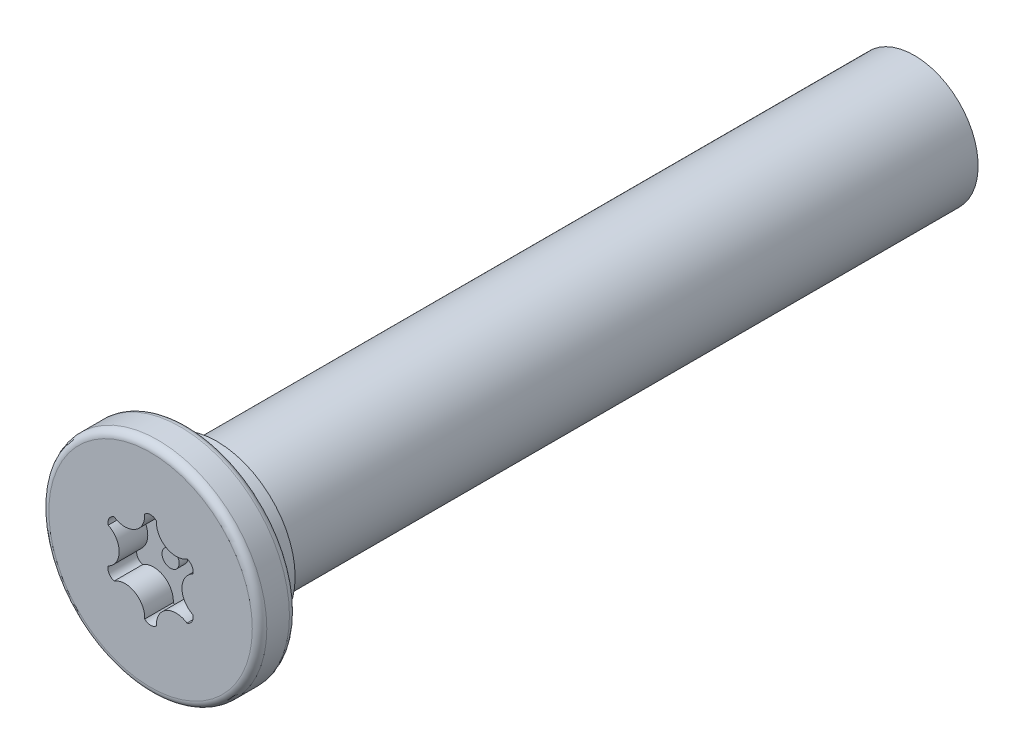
ISO-10303-21;
HEADER;
FILE_DESCRIPTION(('STEP AP214'),'2;1');
FILE_NAME('part.step','',(''),(''),'','','');
FILE_SCHEMA(('AUTOMOTIVE_DESIGN { 1 0 10303 214 1 1 1 1 }'));
ENDSEC;
DATA;
#1=APPLICATION_CONTEXT('core data for automotive mechanical design processes');
#2=APPLICATION_PROTOCOL_DEFINITION('international standard','automotive_design',2000,#1);
#3=PRODUCT_CONTEXT('',#1,'mechanical');
#4=PRODUCT('Part','Part','',(#3));
#5=PRODUCT_RELATED_PRODUCT_CATEGORY('part','',(#4));
#6=PRODUCT_DEFINITION_FORMATION('','',#4);
#7=PRODUCT_DEFINITION_CONTEXT('part definition',#1,'design');
#8=PRODUCT_DEFINITION('design','',#6,#7);
#9=PRODUCT_DEFINITION_SHAPE('','',#8);
#10=(LENGTH_UNIT() NAMED_UNIT(*) SI_UNIT(.MILLI.,.METRE.));
#11=(NAMED_UNIT(*) PLANE_ANGLE_UNIT() SI_UNIT($,.RADIAN.));
#12=(NAMED_UNIT(*) SI_UNIT($,.STERADIAN.) SOLID_ANGLE_UNIT());
#13=UNCERTAINTY_MEASURE_WITH_UNIT(LENGTH_MEASURE(1.E-05),#10,'distance_accuracy_value','');
#14=(GEOMETRIC_REPRESENTATION_CONTEXT(3) GLOBAL_UNCERTAINTY_ASSIGNED_CONTEXT((#13)) GLOBAL_UNIT_ASSIGNED_CONTEXT((#10,
#11,#12)) REPRESENTATION_CONTEXT('',''));
#15=CARTESIAN_POINT('',(0.,0.,0.));
#16=DIRECTION('',(0.,0.,1.));
#17=DIRECTION('',(1.,0.,0.));
#18=AXIS2_PLACEMENT_3D('',#15,#16,#17);
#19=CARTESIAN_POINT('',(0.,0.,0.));
#20=DIRECTION('',(0.,0.,1.));
#21=DIRECTION('',(1.,0.,0.));
#22=AXIS2_PLACEMENT_3D('',#19,#20,#21);
#23=PLANE('',#22);
#24=CARTESIAN_POINT('',(0.,0.,0.));
#25=DIRECTION('',(0.,0.,1.));
#26=DIRECTION('',(1.,0.,0.));
#27=AXIS2_PLACEMENT_3D('',#24,#25,#26);
#28=CIRCLE('',#27,3.55599999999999);
#29=CARTESIAN_POINT('',(3.55599999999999,0.,0.));
#30=VERTEX_POINT('',#29);
#31=EDGE_CURVE('E54',#30,#30,#28,.T.);
#32=ORIENTED_EDGE('',*,*,#31,.T.);
#33=EDGE_LOOP('',(#32));
#34=FACE_BOUND('',#33,.T.);
#35=CARTESIAN_POINT('',(0.893828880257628,1.54815703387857,0.));
#36=DIRECTION('',(0.,0.,1.));
#37=DIRECTION('',(1.,0.,0.));
#38=AXIS2_PLACEMENT_3D('',#35,#36,#37);
#39=CIRCLE('',#38,0.69);
#40=CARTESIAN_POINT('',(0.205060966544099,1.58937306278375,0.));
#41=VERTEX_POINT('',#40);
#42=CARTESIAN_POINT('',(1.27390696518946,0.972274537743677,0.));
#43=VERTEX_POINT('',#42);
#44=EDGE_CURVE('E181',#41,#43,#39,.T.);
#45=ORIENTED_EDGE('',*,*,#44,.T.);
#46=CARTESIAN_POINT('',(1.19884944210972,0.692156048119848,0.));
#47=DIRECTION('',(0.,0.,1.));
#48=DIRECTION('',(1.,0.,0.));
#49=AXIS2_PLACEMENT_3D('',#46,#47,#48);
#50=CIRCLE('',#49,0.29);
#51=CARTESIAN_POINT('',(1.47896793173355,0.617098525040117,0.));
#52=VERTEX_POINT('',#51);
#53=EDGE_CURVE('E61',#43,#52,#50,.F.);
#54=ORIENTED_EDGE('',*,*,#53,.T.);
#55=CARTESIAN_POINT('',(1.78765776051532,0.,0.));
#56=DIRECTION('',(0.,0.,1.));
#57=DIRECTION('',(1.,0.,0.));
#58=AXIS2_PLACEMENT_3D('',#55,#56,#57);
#59=CIRCLE('',#58,0.69);
#60=CARTESIAN_POINT('',(1.47896793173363,-0.617098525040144,0.));
#61=VERTEX_POINT('',#60);
#62=EDGE_CURVE('E111',#52,#61,#59,.T.);
#63=ORIENTED_EDGE('',*,*,#62,.T.);
#64=CARTESIAN_POINT('',(1.1988494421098,-0.692156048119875,0.));
#65=DIRECTION('',(0.,0.,1.));
#66=DIRECTION('',(1.,0.,0.));
#67=AXIS2_PLACEMENT_3D('',#64,#65,#66);
#68=CIRCLE('',#67,0.29);
#69=CARTESIAN_POINT('',(1.27390696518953,-0.972274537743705,0.));
#70=VERTEX_POINT('',#69);
#71=EDGE_CURVE('E216',#61,#70,#68,.F.);
#72=ORIENTED_EDGE('',*,*,#71,.T.);
#73=CARTESIAN_POINT('',(0.893828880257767,-1.54815703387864,0.));
#74=DIRECTION('',(0.,0.,1.));
#75=DIRECTION('',(1.,0.,0.));
#76=AXIS2_PLACEMENT_3D('',#73,#74,#75);
#77=CIRCLE('',#76,0.69);
#78=CARTESIAN_POINT('',(0.205060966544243,-1.5893730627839,0.));
#79=VERTEX_POINT('',#78);
#80=EDGE_CURVE('E160',#70,#79,#77,.T.);
#81=ORIENTED_EDGE('',*,*,#80,.T.);
#82=CARTESIAN_POINT('',(1.43067375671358E-13,-1.3843120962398,0.));
#83=DIRECTION('',(0.,0.,1.));
#84=DIRECTION('',(1.,0.,0.));
#85=AXIS2_PLACEMENT_3D('',#82,#83,#84);
#86=CIRCLE('',#85,0.29);
#87=CARTESIAN_POINT('',(-0.205060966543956,-1.5893730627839,0.));
#88=VERTEX_POINT('',#87);
#89=EDGE_CURVE('E210',#79,#88,#86,.F.);
#90=ORIENTED_EDGE('',*,*,#89,.T.);
#91=CARTESIAN_POINT('',(-0.893828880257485,-1.54815703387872,0.));
#92=DIRECTION('',(0.,0.,1.));
#93=DIRECTION('',(1.,0.,0.));
#94=AXIS2_PLACEMENT_3D('',#91,#92,#93);
#95=CIRCLE('',#94,0.69);
#96=CARTESIAN_POINT('',(-1.27390696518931,-0.97227453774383,0.));
#97=VERTEX_POINT('',#96);
#98=EDGE_CURVE('E206',#88,#97,#95,.T.);
#99=ORIENTED_EDGE('',*,*,#98,.T.);
#100=CARTESIAN_POINT('',(-1.19884944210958,-0.69215604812,0.));
#101=DIRECTION('',(0.,0.,1.));
#102=DIRECTION('',(1.,0.,0.));
#103=AXIS2_PLACEMENT_3D('',#100,#101,#102);
#104=CIRCLE('',#103,0.29);
#105=CARTESIAN_POINT('',(-1.47896793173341,-0.617098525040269,0.));
#106=VERTEX_POINT('',#105);
#107=EDGE_CURVE('E202',#97,#106,#104,.F.);
#108=ORIENTED_EDGE('',*,*,#107,.T.);
#109=CARTESIAN_POINT('',(-1.78765776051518,-1.56674837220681E-13,0.));
#110=DIRECTION('',(0.,0.,1.));
#111=DIRECTION('',(1.,0.,0.));
#112=AXIS2_PLACEMENT_3D('',#109,#110,#111);
#113=CIRCLE('',#112,0.69);
#114=CARTESIAN_POINT('',(-1.47896793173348,0.617098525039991,0.));
#115=VERTEX_POINT('',#114);
#116=EDGE_CURVE('E198',#106,#115,#113,.T.);
#117=ORIENTED_EDGE('',*,*,#116,.T.);
#118=CARTESIAN_POINT('',(-1.19884944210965,0.692156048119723,0.));
#119=DIRECTION('',(0.,0.,1.));
#120=DIRECTION('',(1.,0.,0.));
#121=AXIS2_PLACEMENT_3D('',#118,#119,#120);
#122=CIRCLE('',#121,0.29);
#123=CARTESIAN_POINT('',(-1.27390696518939,0.972274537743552,0.));
#124=VERTEX_POINT('',#123);
#125=EDGE_CURVE('E194',#115,#124,#122,.F.);
#126=ORIENTED_EDGE('',*,*,#125,.T.);
#127=CARTESIAN_POINT('',(-0.893828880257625,1.54815703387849,0.));
#128=DIRECTION('',(0.,0.,1.));
#129=DIRECTION('',(1.,0.,0.));
#130=AXIS2_PLACEMENT_3D('',#127,#128,#129);
#131=CIRCLE('',#130,0.690000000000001);
#132=CARTESIAN_POINT('',(-0.205060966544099,1.58937306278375,0.));
#133=VERTEX_POINT('',#132);
#134=EDGE_CURVE('E190',#124,#133,#131,.T.);
#135=ORIENTED_EDGE('',*,*,#134,.T.);
#136=CARTESIAN_POINT('',(0.,1.38431209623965,0.));
#137=DIRECTION('',(0.,0.,1.));
#138=DIRECTION('',(1.,0.,0.));
#139=AXIS2_PLACEMENT_3D('',#136,#137,#138);
#140=CIRCLE('',#139,0.29);
#141=EDGE_CURVE('E186',#133,#41,#140,.F.);
#142=ORIENTED_EDGE('',*,*,#141,.T.);
#143=EDGE_LOOP('',(#45,#54,#63,#72,#81,#90,#99,#108,#117,#126,#135,#142));
#144=FACE_BOUND('',#143,.T.);
#145=ADVANCED_FACE('F45',(#34,#144),#23,.T.);
#146=CARTESIAN_POINT('',(0.,0.,-1.3));
#147=DIRECTION('',(0.,0.,1.));
#148=DIRECTION('',(1.,0.,0.));
#149=AXIS2_PLACEMENT_3D('',#146,#147,#148);
#150=PLANE('',#149);
#151=CARTESIAN_POINT('',(0.,0.,-1.3));
#152=DIRECTION('',(0.,0.,1.));
#153=DIRECTION('',(1.,0.,0.));
#154=AXIS2_PLACEMENT_3D('',#151,#152,#153);
#155=CIRCLE('',#154,2.738000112);
#156=CARTESIAN_POINT('',(2.738000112,0.,-1.3));
#157=VERTEX_POINT('',#156);
#158=EDGE_CURVE('E11',#157,#157,#155,.F.);
#159=ORIENTED_EDGE('',*,*,#158,.F.);
#160=EDGE_LOOP('',(#159));
#161=FACE_BOUND('',#160,.T.);
#162=CARTESIAN_POINT('',(0.,0.,-1.3));
#163=DIRECTION('',(0.,0.,1.));
#164=DIRECTION('',(1.,0.,0.));
#165=AXIS2_PLACEMENT_3D('',#162,#163,#164);
#166=CIRCLE('',#165,3.55599999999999);
#167=CARTESIAN_POINT('',(3.55599999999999,0.,-1.3));
#168=VERTEX_POINT('',#167);
#169=EDGE_CURVE('E260',#168,#168,#166,.F.);
#170=ORIENTED_EDGE('',*,*,#169,.T.);
#171=EDGE_LOOP('',(#170));
#172=FACE_BOUND('',#171,.T.);
#173=ADVANCED_FACE('F283',(#161,#172),#150,.F.);
#174=CARTESIAN_POINT('',(0.,0.,-1.3));
#175=DIRECTION('',(0.,0.,1.));
#176=DIRECTION('',(1.,0.,0.));
#177=AXIS2_PLACEMENT_3D('',#174,#175,#176);
#178=CYLINDRICAL_SURFACE('',#177,3.80999999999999);
#179=CARTESIAN_POINT('',(0.,0.,-1.046));
#180=DIRECTION('',(0.,0.,1.));
#181=DIRECTION('',(1.,0.,0.));
#182=AXIS2_PLACEMENT_3D('',#179,#180,#181);
#183=CIRCLE('',#182,3.80999999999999);
#184=CARTESIAN_POINT('',(3.80999999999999,0.,-1.046));
#185=VERTEX_POINT('',#184);
#186=EDGE_CURVE('E256',#185,#185,#183,.T.);
#187=ORIENTED_EDGE('',*,*,#186,.T.);
#188=EDGE_LOOP('',(#187));
#189=FACE_BOUND('',#188,.T.);
#190=CARTESIAN_POINT('',(0.,0.,-0.254));
#191=DIRECTION('',(0.,0.,1.));
#192=DIRECTION('',(1.,0.,0.));
#193=AXIS2_PLACEMENT_3D('',#190,#191,#192);
#194=CIRCLE('',#193,3.80999999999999);
#195=CARTESIAN_POINT('',(3.80999999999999,0.,-0.254));
#196=VERTEX_POINT('',#195);
#197=EDGE_CURVE('E225',#196,#196,#194,.F.);
#198=ORIENTED_EDGE('',*,*,#197,.T.);
#199=EDGE_LOOP('',(#198));
#200=FACE_BOUND('',#199,.T.);
#201=ADVANCED_FACE('F289',(#189,#200),#178,.T.);
#202=CARTESIAN_POINT('',(1.19884944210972,0.692156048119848,-1.));
#203=DIRECTION('',(0.,0.,1.));
#204=DIRECTION('',(1.,0.,0.));
#205=AXIS2_PLACEMENT_3D('',#202,#203,#204);
#206=CYLINDRICAL_SURFACE('',#205,0.29);
#207=ORIENTED_EDGE('',*,*,#53,.F.);
#208=DIRECTION('',(0.,0.,1.));
#209=VECTOR('',#208,1.);
#210=CARTESIAN_POINT('',(1.27390696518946,0.972274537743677,-1.));
#211=LINE('',#210,#209);
#212=CARTESIAN_POINT('',(1.27390696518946,0.972274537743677,-1.));
#213=VERTEX_POINT('',#212);
#214=EDGE_CURVE('E178',#213,#43,#211,.T.);
#215=ORIENTED_EDGE('',*,*,#214,.F.);
#216=CARTESIAN_POINT('',(1.19884944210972,0.692156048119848,-1.));
#217=DIRECTION('',(0.,0.,1.));
#218=DIRECTION('',(1.,0.,0.));
#219=AXIS2_PLACEMENT_3D('',#216,#217,#218);
#220=CIRCLE('',#219,0.29);
#221=CARTESIAN_POINT('',(1.47896793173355,0.617098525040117,-1.));
#222=VERTEX_POINT('',#221);
#223=EDGE_CURVE('E221',#213,#222,#220,.F.);
#224=ORIENTED_EDGE('',*,*,#223,.T.);
#225=DIRECTION('',(0.,0.,1.));
#226=VECTOR('',#225,1.);
#227=CARTESIAN_POINT('',(1.47896793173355,0.617098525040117,-1.));
#228=LINE('',#227,#226);
#229=EDGE_CURVE('E222',#222,#52,#228,.T.);
#230=ORIENTED_EDGE('',*,*,#229,.T.);
#231=EDGE_LOOP('',(#207,#215,#224,#230));
#232=FACE_BOUND('',#231,.T.);
#233=ADVANCED_FACE('F294',(#232),#206,.F.);
#234=CARTESIAN_POINT('',(1.78765776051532,0.,-1.));
#235=DIRECTION('',(0.,0.,1.));
#236=DIRECTION('',(1.,0.,0.));
#237=AXIS2_PLACEMENT_3D('',#234,#235,#236);
#238=CYLINDRICAL_SURFACE('',#237,0.69);
#239=ORIENTED_EDGE('',*,*,#62,.F.);
#240=ORIENTED_EDGE('',*,*,#229,.F.);
#241=CARTESIAN_POINT('',(1.78765776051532,0.,-1.));
#242=DIRECTION('',(0.,0.,1.));
#243=DIRECTION('',(1.,0.,0.));
#244=AXIS2_PLACEMENT_3D('',#241,#242,#243);
#245=CIRCLE('',#244,0.69);
#246=CARTESIAN_POINT('',(1.47896793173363,-0.617098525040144,-1.));
#247=VERTEX_POINT('',#246);
#248=EDGE_CURVE('E70',#222,#247,#245,.T.);
#249=ORIENTED_EDGE('',*,*,#248,.T.);
#250=DIRECTION('',(0.,0.,1.));
#251=VECTOR('',#250,1.);
#252=CARTESIAN_POINT('',(1.47896793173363,-0.617098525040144,-1.));
#253=LINE('',#252,#251);
#254=EDGE_CURVE('E151',#247,#61,#253,.T.);
#255=ORIENTED_EDGE('',*,*,#254,.T.);
#256=EDGE_LOOP('',(#239,#240,#249,#255));
#257=FACE_BOUND('',#256,.T.);
#258=ADVANCED_FACE('F301',(#257),#238,.T.);
#259=CARTESIAN_POINT('',(1.1988494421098,-0.692156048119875,-1.));
#260=DIRECTION('',(0.,0.,1.));
#261=DIRECTION('',(1.,0.,0.));
#262=AXIS2_PLACEMENT_3D('',#259,#260,#261);
#263=CYLINDRICAL_SURFACE('',#262,0.29);
#264=ORIENTED_EDGE('',*,*,#71,.F.);
#265=ORIENTED_EDGE('',*,*,#254,.F.);
#266=CARTESIAN_POINT('',(1.1988494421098,-0.692156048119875,-1.));
#267=DIRECTION('',(0.,0.,1.));
#268=DIRECTION('',(1.,0.,0.));
#269=AXIS2_PLACEMENT_3D('',#266,#267,#268);
#270=CIRCLE('',#269,0.29);
#271=CARTESIAN_POINT('',(1.27390696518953,-0.972274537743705,-1.));
#272=VERTEX_POINT('',#271);
#273=EDGE_CURVE('E145',#247,#272,#270,.F.);
#274=ORIENTED_EDGE('',*,*,#273,.T.);
#275=DIRECTION('',(0.,0.,1.));
#276=VECTOR('',#275,1.);
#277=CARTESIAN_POINT('',(1.27390696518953,-0.972274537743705,-1.));
#278=LINE('',#277,#276);
#279=EDGE_CURVE('E149',#272,#70,#278,.T.);
#280=ORIENTED_EDGE('',*,*,#279,.T.);
#281=EDGE_LOOP('',(#264,#265,#274,#280));
#282=FACE_BOUND('',#281,.T.);
#283=ADVANCED_FACE('F148',(#282),#263,.F.);
#284=CARTESIAN_POINT('',(0.893828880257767,-1.54815703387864,-1.));
#285=DIRECTION('',(0.,0.,1.));
#286=DIRECTION('',(1.,0.,0.));
#287=AXIS2_PLACEMENT_3D('',#284,#285,#286);
#288=CYLINDRICAL_SURFACE('',#287,0.69);
#289=ORIENTED_EDGE('',*,*,#80,.F.);
#290=ORIENTED_EDGE('',*,*,#279,.F.);
#291=CARTESIAN_POINT('',(0.893828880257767,-1.54815703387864,-1.));
#292=DIRECTION('',(0.,0.,1.));
#293=DIRECTION('',(1.,0.,0.));
#294=AXIS2_PLACEMENT_3D('',#291,#292,#293);
#295=CIRCLE('',#294,0.69);
#296=CARTESIAN_POINT('',(0.205060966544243,-1.5893730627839,-1.));
#297=VERTEX_POINT('',#296);
#298=EDGE_CURVE('E154',#272,#297,#295,.T.);
#299=ORIENTED_EDGE('',*,*,#298,.T.);
#300=DIRECTION('',(0.,0.,1.));
#301=VECTOR('',#300,1.);
#302=CARTESIAN_POINT('',(0.205060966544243,-1.5893730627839,-1.));
#303=LINE('',#302,#301);
#304=EDGE_CURVE('E163',#297,#79,#303,.T.);
#305=ORIENTED_EDGE('',*,*,#304,.T.);
#306=EDGE_LOOP('',(#289,#290,#299,#305));
#307=FACE_BOUND('',#306,.T.);
#308=ADVANCED_FACE('F157',(#307),#288,.T.);
#309=CARTESIAN_POINT('',(1.43067375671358E-13,-1.3843120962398,-1.));
#310=DIRECTION('',(0.,0.,1.));
#311=DIRECTION('',(1.,0.,0.));
#312=AXIS2_PLACEMENT_3D('',#309,#310,#311);
#313=CYLINDRICAL_SURFACE('',#312,0.29);
#314=ORIENTED_EDGE('',*,*,#89,.F.);
#315=ORIENTED_EDGE('',*,*,#304,.F.);
#316=CARTESIAN_POINT('',(1.43067375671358E-13,-1.3843120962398,-1.));
#317=DIRECTION('',(0.,0.,1.));
#318=DIRECTION('',(1.,0.,0.));
#319=AXIS2_PLACEMENT_3D('',#316,#317,#318);
#320=CIRCLE('',#319,0.29);
#321=CARTESIAN_POINT('',(-0.205060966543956,-1.5893730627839,-1.));
#322=VERTEX_POINT('',#321);
#323=EDGE_CURVE('E168',#297,#322,#320,.F.);
#324=ORIENTED_EDGE('',*,*,#323,.T.);
#325=DIRECTION('',(0.,0.,1.));
#326=VECTOR('',#325,1.);
#327=CARTESIAN_POINT('',(-0.205060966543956,-1.5893730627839,-1.));
#328=LINE('',#327,#326);
#329=EDGE_CURVE('E230',#322,#88,#328,.T.);
#330=ORIENTED_EDGE('',*,*,#329,.T.);
#331=EDGE_LOOP('',(#314,#315,#324,#330));
#332=FACE_BOUND('',#331,.T.);
#333=ADVANCED_FACE('F318',(#332),#313,.F.);
#334=CARTESIAN_POINT('',(-0.893828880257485,-1.54815703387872,-1.));
#335=DIRECTION('',(0.,0.,1.));
#336=DIRECTION('',(1.,0.,0.));
#337=AXIS2_PLACEMENT_3D('',#334,#335,#336);
#338=CYLINDRICAL_SURFACE('',#337,0.69);
#339=ORIENTED_EDGE('',*,*,#98,.F.);
#340=ORIENTED_EDGE('',*,*,#329,.F.);
#341=CARTESIAN_POINT('',(-0.893828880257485,-1.54815703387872,-1.));
#342=DIRECTION('',(0.,0.,1.));
#343=DIRECTION('',(1.,0.,0.));
#344=AXIS2_PLACEMENT_3D('',#341,#342,#343);
#345=CIRCLE('',#344,0.69);
#346=CARTESIAN_POINT('',(-1.27390696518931,-0.97227453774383,-1.));
#347=VERTEX_POINT('',#346);
#348=EDGE_CURVE('E172',#322,#347,#345,.T.);
#349=ORIENTED_EDGE('',*,*,#348,.T.);
#350=DIRECTION('',(0.,0.,1.));
#351=VECTOR('',#350,1.);
#352=CARTESIAN_POINT('',(-1.27390696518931,-0.97227453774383,-1.));
#353=LINE('',#352,#351);
#354=EDGE_CURVE('E233',#347,#97,#353,.T.);
#355=ORIENTED_EDGE('',*,*,#354,.T.);
#356=EDGE_LOOP('',(#339,#340,#349,#355));
#357=FACE_BOUND('',#356,.T.);
#358=ADVANCED_FACE('F321',(#357),#338,.T.);
#359=CARTESIAN_POINT('',(-1.19884944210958,-0.69215604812,-1.));
#360=DIRECTION('',(0.,0.,1.));
#361=DIRECTION('',(1.,0.,0.));
#362=AXIS2_PLACEMENT_3D('',#359,#360,#361);
#363=CYLINDRICAL_SURFACE('',#362,0.29);
#364=ORIENTED_EDGE('',*,*,#107,.F.);
#365=ORIENTED_EDGE('',*,*,#354,.F.);
#366=CARTESIAN_POINT('',(-1.19884944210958,-0.69215604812,-1.));
#367=DIRECTION('',(0.,0.,1.));
#368=DIRECTION('',(1.,0.,0.));
#369=AXIS2_PLACEMENT_3D('',#366,#367,#368);
#370=CIRCLE('',#369,0.29);
#371=CARTESIAN_POINT('',(-1.47896793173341,-0.617098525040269,-1.));
#372=VERTEX_POINT('',#371);
#373=EDGE_CURVE('E374',#347,#372,#370,.F.);
#374=ORIENTED_EDGE('',*,*,#373,.T.);
#375=DIRECTION('',(0.,0.,1.));
#376=VECTOR('',#375,1.);
#377=CARTESIAN_POINT('',(-1.47896793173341,-0.617098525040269,-1.));
#378=LINE('',#377,#376);
#379=EDGE_CURVE('E236',#372,#106,#378,.T.);
#380=ORIENTED_EDGE('',*,*,#379,.T.);
#381=EDGE_LOOP('',(#364,#365,#374,#380));
#382=FACE_BOUND('',#381,.T.);
#383=ADVANCED_FACE('F325',(#382),#363,.F.);
#384=CARTESIAN_POINT('',(-1.78765776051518,-1.56674837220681E-13,-1.));
#385=DIRECTION('',(0.,0.,1.));
#386=DIRECTION('',(1.,0.,0.));
#387=AXIS2_PLACEMENT_3D('',#384,#385,#386);
#388=CYLINDRICAL_SURFACE('',#387,0.69);
#389=ORIENTED_EDGE('',*,*,#116,.F.);
#390=ORIENTED_EDGE('',*,*,#379,.F.);
#391=CARTESIAN_POINT('',(-1.78765776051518,-1.56674837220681E-13,-1.));
#392=DIRECTION('',(0.,0.,1.));
#393=DIRECTION('',(1.,0.,0.));
#394=AXIS2_PLACEMENT_3D('',#391,#392,#393);
#395=CIRCLE('',#394,0.69);
#396=CARTESIAN_POINT('',(-1.47896793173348,0.617098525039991,-1.));
#397=VERTEX_POINT('',#396);
#398=EDGE_CURVE('E371',#372,#397,#395,.T.);
#399=ORIENTED_EDGE('',*,*,#398,.T.);
#400=DIRECTION('',(0.,0.,1.));
#401=VECTOR('',#400,1.);
#402=CARTESIAN_POINT('',(-1.47896793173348,0.617098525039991,-1.));
#403=LINE('',#402,#401);
#404=EDGE_CURVE('E239',#397,#115,#403,.T.);
#405=ORIENTED_EDGE('',*,*,#404,.T.);
#406=EDGE_LOOP('',(#389,#390,#399,#405));
#407=FACE_BOUND('',#406,.T.);
#408=ADVANCED_FACE('F329',(#407),#388,.T.);
#409=CARTESIAN_POINT('',(-1.19884944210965,0.692156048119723,-1.));
#410=DIRECTION('',(0.,0.,1.));
#411=DIRECTION('',(1.,0.,0.));
#412=AXIS2_PLACEMENT_3D('',#409,#410,#411);
#413=CYLINDRICAL_SURFACE('',#412,0.29);
#414=ORIENTED_EDGE('',*,*,#125,.F.);
#415=ORIENTED_EDGE('',*,*,#404,.F.);
#416=CARTESIAN_POINT('',(-1.19884944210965,0.692156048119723,-1.));
#417=DIRECTION('',(0.,0.,1.));
#418=DIRECTION('',(1.,0.,0.));
#419=AXIS2_PLACEMENT_3D('',#416,#417,#418);
#420=CIRCLE('',#419,0.29);
#421=CARTESIAN_POINT('',(-1.27390696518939,0.972274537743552,-1.));
#422=VERTEX_POINT('',#421);
#423=EDGE_CURVE('E364',#397,#422,#420,.F.);
#424=ORIENTED_EDGE('',*,*,#423,.T.);
#425=DIRECTION('',(0.,0.,1.));
#426=VECTOR('',#425,1.);
#427=CARTESIAN_POINT('',(-1.27390696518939,0.972274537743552,-1.));
#428=LINE('',#427,#426);
#429=EDGE_CURVE('E242',#422,#124,#428,.T.);
#430=ORIENTED_EDGE('',*,*,#429,.T.);
#431=EDGE_LOOP('',(#414,#415,#424,#430));
#432=FACE_BOUND('',#431,.T.);
#433=ADVANCED_FACE('F333',(#432),#413,.F.);
#434=CARTESIAN_POINT('',(-0.893828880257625,1.54815703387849,-1.));
#435=DIRECTION('',(0.,0.,1.));
#436=DIRECTION('',(1.,0.,0.));
#437=AXIS2_PLACEMENT_3D('',#434,#435,#436);
#438=CYLINDRICAL_SURFACE('',#437,0.690000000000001);
#439=ORIENTED_EDGE('',*,*,#134,.F.);
#440=ORIENTED_EDGE('',*,*,#429,.F.);
#441=CARTESIAN_POINT('',(-0.893828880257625,1.54815703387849,-1.));
#442=DIRECTION('',(0.,0.,1.));
#443=DIRECTION('',(1.,0.,0.));
#444=AXIS2_PLACEMENT_3D('',#441,#442,#443);
#445=CIRCLE('',#444,0.690000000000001);
#446=CARTESIAN_POINT('',(-0.205060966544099,1.58937306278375,-1.));
#447=VERTEX_POINT('',#446);
#448=EDGE_CURVE('E360',#422,#447,#445,.T.);
#449=ORIENTED_EDGE('',*,*,#448,.T.);
#450=DIRECTION('',(0.,0.,1.));
#451=VECTOR('',#450,1.);
#452=CARTESIAN_POINT('',(-0.205060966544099,1.58937306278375,-1.));
#453=LINE('',#452,#451);
#454=EDGE_CURVE('E245',#447,#133,#453,.T.);
#455=ORIENTED_EDGE('',*,*,#454,.T.);
#456=EDGE_LOOP('',(#439,#440,#449,#455));
#457=FACE_BOUND('',#456,.T.);
#458=ADVANCED_FACE('F337',(#457),#438,.T.);
#459=CARTESIAN_POINT('',(0.,1.38431209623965,-1.));
#460=DIRECTION('',(0.,0.,1.));
#461=DIRECTION('',(1.,0.,0.));
#462=AXIS2_PLACEMENT_3D('',#459,#460,#461);
#463=CYLINDRICAL_SURFACE('',#462,0.29);
#464=ORIENTED_EDGE('',*,*,#141,.F.);
#465=ORIENTED_EDGE('',*,*,#454,.F.);
#466=CARTESIAN_POINT('',(0.,1.38431209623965,-1.));
#467=DIRECTION('',(0.,0.,1.));
#468=DIRECTION('',(1.,0.,0.));
#469=AXIS2_PLACEMENT_3D('',#466,#467,#468);
#470=CIRCLE('',#469,0.29);
#471=CARTESIAN_POINT('',(0.205060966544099,1.58937306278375,-1.));
#472=VERTEX_POINT('',#471);
#473=EDGE_CURVE('E357',#447,#472,#470,.F.);
#474=ORIENTED_EDGE('',*,*,#473,.T.);
#475=DIRECTION('',(0.,0.,1.));
#476=VECTOR('',#475,1.);
#477=CARTESIAN_POINT('',(0.205060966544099,1.58937306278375,-1.));
#478=LINE('',#477,#476);
#479=EDGE_CURVE('E248',#472,#41,#478,.T.);
#480=ORIENTED_EDGE('',*,*,#479,.T.);
#481=EDGE_LOOP('',(#464,#465,#474,#480));
#482=FACE_BOUND('',#481,.T.);
#483=ADVANCED_FACE('F341',(#482),#463,.F.);
#484=CARTESIAN_POINT('',(0.893828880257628,1.54815703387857,-1.));
#485=DIRECTION('',(0.,0.,1.));
#486=DIRECTION('',(1.,0.,0.));
#487=AXIS2_PLACEMENT_3D('',#484,#485,#486);
#488=CYLINDRICAL_SURFACE('',#487,0.69);
#489=ORIENTED_EDGE('',*,*,#44,.F.);
#490=ORIENTED_EDGE('',*,*,#479,.F.);
#491=CARTESIAN_POINT('',(0.893828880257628,1.54815703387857,-1.));
#492=DIRECTION('',(0.,0.,1.));
#493=DIRECTION('',(1.,0.,0.));
#494=AXIS2_PLACEMENT_3D('',#491,#492,#493);
#495=CIRCLE('',#494,0.69);
#496=EDGE_CURVE('E118',#472,#213,#495,.T.);
#497=ORIENTED_EDGE('',*,*,#496,.T.);
#498=ORIENTED_EDGE('',*,*,#214,.T.);
#499=EDGE_LOOP('',(#489,#490,#497,#498));
#500=FACE_BOUND('',#499,.T.);
#501=ADVANCED_FACE('F344',(#500),#488,.T.);
#502=CARTESIAN_POINT('',(0.,0.,-1.));
#503=DIRECTION('',(0.,0.,1.));
#504=DIRECTION('',(1.,0.,0.));
#505=AXIS2_PLACEMENT_3D('',#502,#503,#504);
#506=PLANE('',#505);
#507=CARTESIAN_POINT('',(0.,0.,-1.));
#508=DIRECTION('',(0.,0.,1.));
#509=DIRECTION('',(1.,0.,0.));
#510=AXIS2_PLACEMENT_3D('',#507,#508,#509);
#511=CIRCLE('',#510,0.3);
#512=CARTESIAN_POINT('',(0.3,0.,-1.));
#513=VERTEX_POINT('',#512);
#514=EDGE_CURVE('E396',#513,#513,#511,.T.);
#515=ORIENTED_EDGE('',*,*,#514,.F.);
#516=EDGE_LOOP('',(#515));
#517=FACE_BOUND('',#516,.T.);
#518=ORIENTED_EDGE('',*,*,#223,.F.);
#519=ORIENTED_EDGE('',*,*,#496,.F.);
#520=ORIENTED_EDGE('',*,*,#473,.F.);
#521=ORIENTED_EDGE('',*,*,#448,.F.);
#522=ORIENTED_EDGE('',*,*,#423,.F.);
#523=ORIENTED_EDGE('',*,*,#398,.F.);
#524=ORIENTED_EDGE('',*,*,#373,.F.);
#525=ORIENTED_EDGE('',*,*,#348,.F.);
#526=ORIENTED_EDGE('',*,*,#323,.F.);
#527=ORIENTED_EDGE('',*,*,#298,.F.);
#528=ORIENTED_EDGE('',*,*,#273,.F.);
#529=ORIENTED_EDGE('',*,*,#248,.F.);
#530=EDGE_LOOP('',(#518,#519,#520,#521,#522,#523,#524,#525,#526,#527,#528,#529));
#531=FACE_BOUND('',#530,.T.);
#532=ADVANCED_FACE('F166',(#517,#531),#506,.T.);
#533=CARTESIAN_POINT('',(0.,0.,-1.046));
#534=DIRECTION('',(0.,0.,1.));
#535=DIRECTION('',(1.,0.,0.));
#536=AXIS2_PLACEMENT_3D('',#533,#534,#535);
#537=TOROIDAL_SURFACE('',#536,3.55599999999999,0.254);
#538=ORIENTED_EDGE('',*,*,#169,.F.);
#539=EDGE_LOOP('',(#538));
#540=FACE_BOUND('',#539,.T.);
#541=ORIENTED_EDGE('',*,*,#186,.F.);
#542=EDGE_LOOP('',(#541));
#543=FACE_BOUND('',#542,.T.);
#544=ADVANCED_FACE('F271',(#540,#543),#537,.T.);
#545=CARTESIAN_POINT('',(0.,0.,-0.254));
#546=DIRECTION('',(0.,0.,1.));
#547=DIRECTION('',(1.,0.,0.));
#548=AXIS2_PLACEMENT_3D('',#545,#546,#547);
#549=TOROIDAL_SURFACE('',#548,3.55599999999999,0.254);
#550=ORIENTED_EDGE('',*,*,#197,.F.);
#551=EDGE_LOOP('',(#550));
#552=FACE_BOUND('',#551,.T.);
#553=ORIENTED_EDGE('',*,*,#31,.F.);
#554=EDGE_LOOP('',(#553));
#555=FACE_BOUND('',#554,.T.);
#556=ADVANCED_FACE('F47',(#552,#555),#549,.T.);
#557=CARTESIAN_POINT('',(0.,0.,-2.316));
#558=DIRECTION('',(0.,0.,-1.));
#559=DIRECTION('',(-1.,0.,0.));
#560=AXIS2_PLACEMENT_3D('',#557,#558,#559);
#561=PLANE('',#560);
#562=CARTESIAN_POINT('',(0.,0.,-2.316));
#563=DIRECTION('',(0.,0.,-1.));
#564=DIRECTION('',(-1.,0.,0.));
#565=AXIS2_PLACEMENT_3D('',#562,#563,#564);
#566=CIRCLE('',#565,2.738000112);
#567=CARTESIAN_POINT('',(-2.738000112,0.,-2.316));
#568=VERTEX_POINT('',#567);
#569=EDGE_CURVE('E182',#568,#568,#566,.T.);
#570=ORIENTED_EDGE('',*,*,#569,.T.);
#571=EDGE_LOOP('',(#570));
#572=FACE_BOUND('',#571,.T.);
#573=CARTESIAN_POINT('',(0.,0.,-2.316));
#574=DIRECTION('',(0.,0.,-1.));
#575=DIRECTION('',(-1.,0.,0.));
#576=AXIS2_PLACEMENT_3D('',#573,#574,#575);
#577=CIRCLE('',#576,2.230000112);
#578=CARTESIAN_POINT('',(-2.230000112,0.,-2.316));
#579=VERTEX_POINT('',#578);
#580=EDGE_CURVE('E400',#579,#579,#577,.T.);
#581=ORIENTED_EDGE('',*,*,#580,.F.);
#582=EDGE_LOOP('',(#581));
#583=FACE_BOUND('',#582,.T.);
#584=ADVANCED_FACE('F270',(#572,#583),#561,.T.);
#585=CARTESIAN_POINT('',(0.,0.,-2.316));
#586=DIRECTION('',(0.,0.,1.));
#587=DIRECTION('',(1.,0.,0.));
#588=AXIS2_PLACEMENT_3D('',#585,#586,#587);
#589=CYLINDRICAL_SURFACE('',#588,2.738000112);
#590=ORIENTED_EDGE('',*,*,#569,.F.);
#591=EDGE_LOOP('',(#590));
#592=FACE_BOUND('',#591,.T.);
#593=ORIENTED_EDGE('',*,*,#158,.T.);
#594=EDGE_LOOP('',(#593));
#595=FACE_BOUND('',#594,.T.);
#596=ADVANCED_FACE('F277',(#592,#595),#589,.T.);
#597=CARTESIAN_POINT('',(0.,0.,-0.7));
#598=DIRECTION('',(0.,0.,-1.));
#599=DIRECTION('',(-1.,0.,0.));
#600=AXIS2_PLACEMENT_3D('',#597,#598,#599);
#601=CYLINDRICAL_SURFACE('',#600,0.3);
#602=CARTESIAN_POINT('',(0.,0.,-0.7));
#603=DIRECTION('',(0.,0.,1.));
#604=DIRECTION('',(1.,0.,0.));
#605=AXIS2_PLACEMENT_3D('',#602,#603,#604);
#606=CIRCLE('',#605,0.3);
#607=CARTESIAN_POINT('',(0.3,0.,-0.7));
#608=VERTEX_POINT('',#607);
#609=EDGE_CURVE('E395',#608,#608,#606,.T.);
#610=ORIENTED_EDGE('',*,*,#609,.F.);
#611=EDGE_LOOP('',(#610));
#612=FACE_BOUND('',#611,.T.);
#613=ORIENTED_EDGE('',*,*,#514,.T.);
#614=EDGE_LOOP('',(#613));
#615=FACE_BOUND('',#614,.T.);
#616=ADVANCED_FACE('F424',(#612,#615),#601,.T.);
#617=CARTESIAN_POINT('',(0.,0.,-0.7));
#618=DIRECTION('',(0.,0.,1.));
#619=DIRECTION('',(1.,0.,0.));
#620=AXIS2_PLACEMENT_3D('',#617,#618,#619);
#621=PLANE('',#620);
#622=ORIENTED_EDGE('',*,*,#609,.T.);
#623=EDGE_LOOP('',(#622));
#624=FACE_BOUND('',#623,.T.);
#625=ADVANCED_FACE('F416',(#624),#621,.T.);
#626=CARTESIAN_POINT('',(0.,0.,-26.7));
#627=DIRECTION('',(0.,0.,1.));
#628=DIRECTION('',(1.,0.,0.));
#629=AXIS2_PLACEMENT_3D('',#626,#627,#628);
#630=CYLINDRICAL_SURFACE('',#629,2.230000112);
#631=ORIENTED_EDGE('',*,*,#580,.T.);
#632=EDGE_LOOP('',(#631));
#633=FACE_BOUND('',#632,.T.);
#634=CARTESIAN_POINT('',(0.,0.,-26.7));
#635=DIRECTION('',(0.,0.,-1.));
#636=DIRECTION('',(-1.,0.,0.));
#637=AXIS2_PLACEMENT_3D('',#634,#635,#636);
#638=CIRCLE('',#637,2.230000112);
#639=CARTESIAN_POINT('',(-2.230000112,0.,-26.7));
#640=VERTEX_POINT('',#639);
#641=EDGE_CURVE('E407',#640,#640,#638,.T.);
#642=ORIENTED_EDGE('',*,*,#641,.F.);
#643=EDGE_LOOP('',(#642));
#644=FACE_BOUND('',#643,.T.);
#645=ADVANCED_FACE('F414',(#633,#644),#630,.T.);
#646=CARTESIAN_POINT('',(0.,0.,-26.7));
#647=DIRECTION('',(0.,0.,-1.));
#648=DIRECTION('',(-1.,0.,0.));
#649=AXIS2_PLACEMENT_3D('',#646,#647,#648);
#650=PLANE('',#649);
#651=ORIENTED_EDGE('',*,*,#641,.T.);
#652=EDGE_LOOP('',(#651));
#653=FACE_BOUND('',#652,.T.);
#654=ADVANCED_FACE('F412',(#653),#650,.T.);
#655=CLOSED_SHELL('',(#145,#173,#201,#233,#258,#283,#308,#333,#358,#383,#408,#433,#458,#483,
#501,#532,#544,#556,#584,#596,#616,#625,#645,#654));
#656=MANIFOLD_SOLID_BREP('B2',#655);
#657=ADVANCED_BREP_SHAPE_REPRESENTATION('',(#18,#656),#14);
#658=SHAPE_DEFINITION_REPRESENTATION(#9,#657);
ENDSEC;
END-ISO-10303-21;
